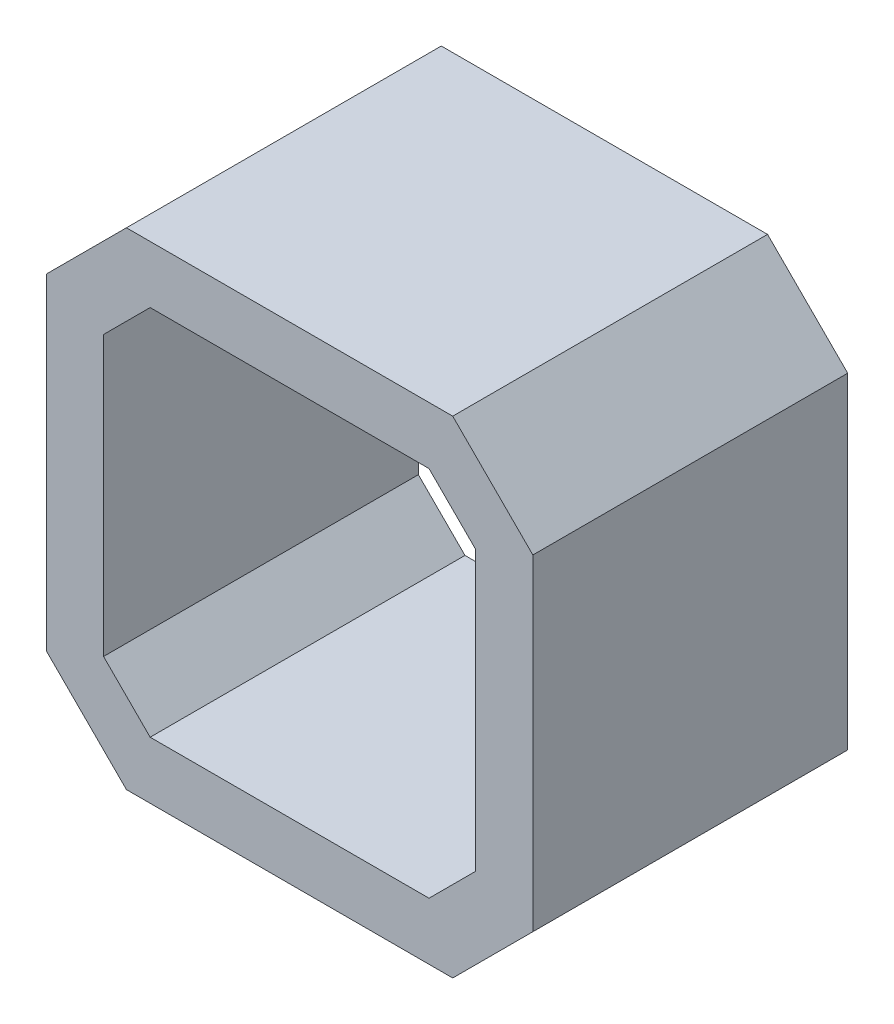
from build123d import *

# Parameters (mm, degrees)
BOSS_EXTRUDE1_DEPTH = 27.5


with BuildPart() as part:
    # Sketch1 → Boss-Extrude1 (new body)
    with BuildSketch(Plane.XY):
        Polygon((-21.25, 14.25), (-14.25, 21.25), (14.25, 21.25), (21.25, 14.25), (21.25, -14.25), (14.25, -21.25), (-14.25, -21.25), (-21.25, -14.25), align=None)
        Polygon((-12.178932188, 16.25), (12.178932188, 16.25), (16.25, 12.178932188), (16.25, -12.178932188), (12.178932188, -16.25), (-12.178932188, -16.25), (-16.25, -12.178932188), (-16.25, 12.178932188), align=None, mode=Mode.SUBTRACT)
    extrude(amount=BOSS_EXTRUDE1_DEPTH)


solid = part.part
